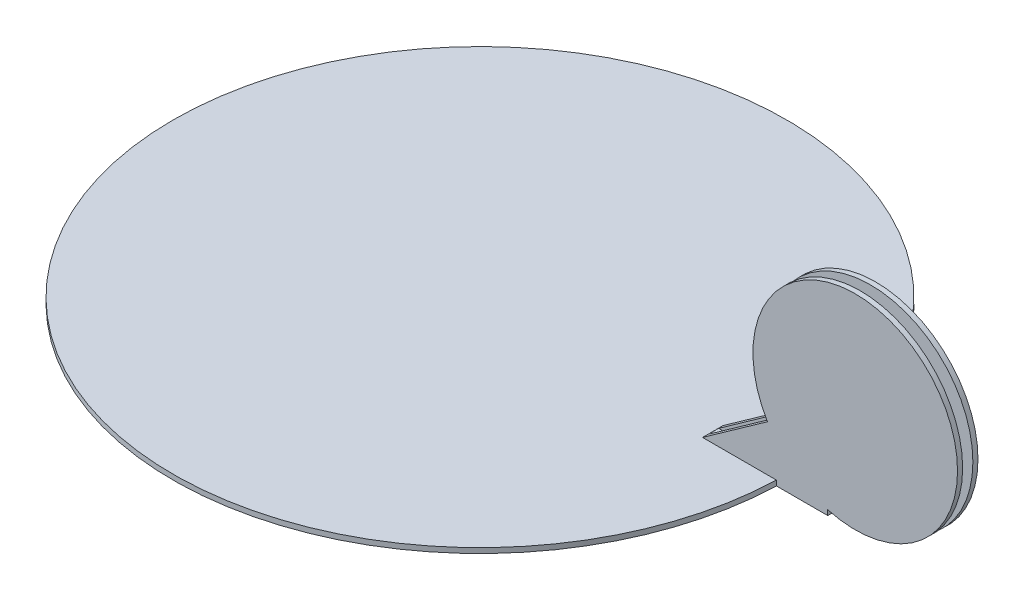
from build123d import *

# Parameters (mm, degrees)
SKETCH1_R                = 76.2
BOSS_EXTRUDE1_DEPTH      = 1.27
BOSS_EXTRUDE2_DEPTH      = 2.54
BOSS_EXTRUDE2_DEPTH_BACK = 2.54
SKETCH4_W                = 48.767873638
SKETCH4_H                = 2.54
CUT_EXTRUDE17_DEPTH      = 152.4
SKETCH5_W                = 2.54
SKETCH5_H                = 41.417563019
CUT_EXTRUDE18_DEPTH      = 152.4


with BuildPart() as part:
    # Sketch1 → Boss-Extrude1 (new body)
    with BuildSketch(Plane(origin=(0, 0, 0), x_dir=(1, 0, 0), z_dir=(0, 1, 0))):
        with Locations(Location((0, 0, 0), (0, 0, 270))):
            Circle(SKETCH1_R)
    extrude(amount=BOSS_EXTRUDE1_DEPTH)

    # Sketch2 → Boss-Extrude2 (add, two sides: drawn at the far end of the back side and taken through both)
    with BuildSketch(Plane.XY.offset(-BOSS_EXTRUDE2_DEPTH_BACK)):
        with BuildLine():
            Line((57.810154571, 1.27), (73.930081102, 12.7))
            ThreePointArc((73.930081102, 12.7), (111.144971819, 45.922415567), (88.9, 1.27))
            Line((88.9, 1.27), (88.9, 0))
            Line((88.9, 0), (76.2, 0))
            Line((76.2, 0), (73.051699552, 0))
            Line((73.051699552, 0), (73.051699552, 1.27))
            Line((73.051699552, 1.27), (57.810154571, 1.27))
        make_face()
    extrude(amount=BOSS_EXTRUDE2_DEPTH + BOSS_EXTRUDE2_DEPTH_BACK)

    # Sketch4 → Cut-Extrude17 (cut)
    with BuildSketch(Plane(origin=(0, 0, 0), x_dir=(1, 0, 0), z_dir=(0, 1, 0))):
        with Locations((101.318527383, 0)):
            Rectangle(SKETCH4_W, SKETCH4_H)
    extrude(amount=CUT_EXTRUDE17_DEPTH, mode=Mode.SUBTRACT)

    # Sketch5 → Cut-Extrude18 (cut)
    with BuildSketch(Plane(origin=(76.934590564, 0, 0), x_dir=(0, 0, -1), z_dir=(1, 0, 0))):
        with Locations((0, 22.109593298)):
            Rectangle(SKETCH5_W, SKETCH5_H)
    extrude(amount=-CUT_EXTRUDE18_DEPTH, mode=Mode.SUBTRACT)


solid = part.part
